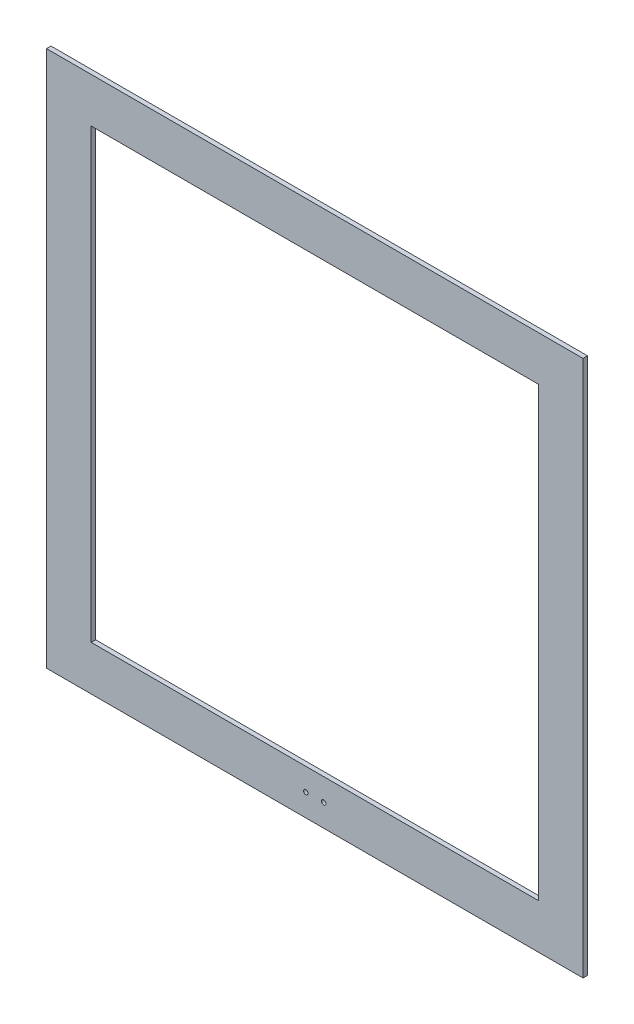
ISO-10303-21;
HEADER;
FILE_DESCRIPTION(('STEP AP214'),'2;1');
FILE_NAME('part.step','',(''),(''),'','','');
FILE_SCHEMA(('AUTOMOTIVE_DESIGN { 1 0 10303 214 1 1 1 1 }'));
ENDSEC;
DATA;
#1=APPLICATION_CONTEXT('core data for automotive mechanical design processes');
#2=APPLICATION_PROTOCOL_DEFINITION('international standard','automotive_design',2000,#1);
#3=PRODUCT_CONTEXT('',#1,'mechanical');
#4=PRODUCT('Part','Part','',(#3));
#5=PRODUCT_RELATED_PRODUCT_CATEGORY('part','',(#4));
#6=PRODUCT_DEFINITION_FORMATION('','',#4);
#7=PRODUCT_DEFINITION_CONTEXT('part definition',#1,'design');
#8=PRODUCT_DEFINITION('design','',#6,#7);
#9=PRODUCT_DEFINITION_SHAPE('','',#8);
#10=(LENGTH_UNIT() NAMED_UNIT(*) SI_UNIT(.MILLI.,.METRE.));
#11=(NAMED_UNIT(*) PLANE_ANGLE_UNIT() SI_UNIT($,.RADIAN.));
#12=(NAMED_UNIT(*) SI_UNIT($,.STERADIAN.) SOLID_ANGLE_UNIT());
#13=UNCERTAINTY_MEASURE_WITH_UNIT(LENGTH_MEASURE(1.E-05),#10,'distance_accuracy_value','');
#14=(GEOMETRIC_REPRESENTATION_CONTEXT(3) GLOBAL_UNCERTAINTY_ASSIGNED_CONTEXT((#13)) GLOBAL_UNIT_ASSIGNED_CONTEXT((#10,
#11,#12)) REPRESENTATION_CONTEXT('',''));
#15=CARTESIAN_POINT('',(0.,0.,0.));
#16=DIRECTION('',(0.,0.,1.));
#17=DIRECTION('',(1.,0.,0.));
#18=AXIS2_PLACEMENT_3D('',#15,#16,#17);
#19=CARTESIAN_POINT('',(0.,0.,5.));
#20=DIRECTION('',(0.,0.,1.));
#21=DIRECTION('',(1.,0.,0.));
#22=AXIS2_PLACEMENT_3D('',#19,#20,#21);
#23=PLANE('',#22);
#24=CARTESIAN_POINT('',(10.,-275.,5.));
#25=DIRECTION('',(0.,0.,1.));
#26=DIRECTION('',(-1.,0.,0.));
#27=AXIS2_PLACEMENT_3D('',#24,#25,#26);
#28=CIRCLE('',#27,2.5);
#29=CARTESIAN_POINT('',(7.5,-275.,5.));
#30=VERTEX_POINT('',#29);
#31=EDGE_CURVE('E226',#30,#30,#28,.T.);
#32=ORIENTED_EDGE('',*,*,#31,.F.);
#33=EDGE_LOOP('',(#32));
#34=FACE_BOUND('',#33,.T.);
#35=CARTESIAN_POINT('',(-10.,-275.,5.));
#36=DIRECTION('',(0.,0.,1.));
#37=DIRECTION('',(1.,0.,0.));
#38=AXIS2_PLACEMENT_3D('',#35,#36,#37);
#39=CIRCLE('',#38,2.5);
#40=CARTESIAN_POINT('',(-7.5,-275.,5.));
#41=VERTEX_POINT('',#40);
#42=EDGE_CURVE('E230',#41,#41,#39,.T.);
#43=ORIENTED_EDGE('',*,*,#42,.F.);
#44=EDGE_LOOP('',(#43));
#45=FACE_BOUND('',#44,.T.);
#46=DIRECTION('',(0.,1.,0.));
#47=VECTOR('',#46,1.);
#48=CARTESIAN_POINT('',(300.,300.,5.));
#49=LINE('',#48,#47);
#50=CARTESIAN_POINT('',(300.,-300.,5.));
#51=VERTEX_POINT('',#50);
#52=CARTESIAN_POINT('',(300.,300.,5.));
#53=VERTEX_POINT('',#52);
#54=EDGE_CURVE('E135',#51,#53,#49,.T.);
#55=ORIENTED_EDGE('',*,*,#54,.T.);
#56=DIRECTION('',(-1.,0.,0.));
#57=VECTOR('',#56,1.);
#58=CARTESIAN_POINT('',(-299.999999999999,300.,5.));
#59=LINE('',#58,#57);
#60=CARTESIAN_POINT('',(-299.999999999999,300.,5.));
#61=VERTEX_POINT('',#60);
#62=EDGE_CURVE('E138',#53,#61,#59,.T.);
#63=ORIENTED_EDGE('',*,*,#62,.T.);
#64=DIRECTION('',(0.,-1.,0.));
#65=VECTOR('',#64,1.);
#66=CARTESIAN_POINT('',(-299.999999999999,300.,5.));
#67=LINE('',#66,#65);
#68=CARTESIAN_POINT('',(-299.999999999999,-300.,5.));
#69=VERTEX_POINT('',#68);
#70=EDGE_CURVE('E141',#61,#69,#67,.T.);
#71=ORIENTED_EDGE('',*,*,#70,.T.);
#72=DIRECTION('',(1.,0.,0.));
#73=VECTOR('',#72,1.);
#74=CARTESIAN_POINT('',(-299.999999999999,-300.,5.));
#75=LINE('',#74,#73);
#76=EDGE_CURVE('E143',#69,#51,#75,.T.);
#77=ORIENTED_EDGE('',*,*,#76,.T.);
#78=EDGE_LOOP('',(#55,#63,#71,#77));
#79=FACE_BOUND('',#78,.T.);
#80=DIRECTION('',(-1.,0.,0.));
#81=VECTOR('',#80,1.);
#82=CARTESIAN_POINT('',(-250.,250.,5.));
#83=LINE('',#82,#81);
#84=CARTESIAN_POINT('',(250.,250.,5.));
#85=VERTEX_POINT('',#84);
#86=CARTESIAN_POINT('',(-250.,250.,5.));
#87=VERTEX_POINT('',#86);
#88=EDGE_CURVE('E105',#85,#87,#83,.T.);
#89=ORIENTED_EDGE('',*,*,#88,.F.);
#90=DIRECTION('',(0.,1.,0.));
#91=VECTOR('',#90,1.);
#92=CARTESIAN_POINT('',(250.,250.,5.));
#93=LINE('',#92,#91);
#94=CARTESIAN_POINT('',(250.,-250.,5.));
#95=VERTEX_POINT('',#94);
#96=EDGE_CURVE('E97',#95,#85,#93,.T.);
#97=ORIENTED_EDGE('',*,*,#96,.F.);
#98=DIRECTION('',(1.,0.,0.));
#99=VECTOR('',#98,1.);
#100=CARTESIAN_POINT('',(-250.,-250.,5.));
#101=LINE('',#100,#99);
#102=CARTESIAN_POINT('',(-250.,-250.,5.));
#103=VERTEX_POINT('',#102);
#104=EDGE_CURVE('E119',#103,#95,#101,.T.);
#105=ORIENTED_EDGE('',*,*,#104,.F.);
#106=DIRECTION('',(0.,-1.,0.));
#107=VECTOR('',#106,1.);
#108=CARTESIAN_POINT('',(-250.,250.,5.));
#109=LINE('',#108,#107);
#110=EDGE_CURVE('E117',#87,#103,#109,.T.);
#111=ORIENTED_EDGE('',*,*,#110,.F.);
#112=EDGE_LOOP('',(#89,#97,#105,#111));
#113=FACE_BOUND('',#112,.T.);
#114=ADVANCED_FACE('F32',(#34,#45,#79,#113),#23,.T.);
#115=CARTESIAN_POINT('',(0.,0.,0.));
#116=DIRECTION('',(0.,0.,1.));
#117=DIRECTION('',(1.,0.,0.));
#118=AXIS2_PLACEMENT_3D('',#115,#116,#117);
#119=PLANE('',#118);
#120=CARTESIAN_POINT('',(10.,-275.,0.));
#121=DIRECTION('',(0.,0.,1.));
#122=DIRECTION('',(1.,0.,0.));
#123=AXIS2_PLACEMENT_3D('',#120,#121,#122);
#124=CIRCLE('',#123,2.5);
#125=CARTESIAN_POINT('',(12.5,-275.,0.));
#126=VERTEX_POINT('',#125);
#127=EDGE_CURVE('E229',#126,#126,#124,.F.);
#128=ORIENTED_EDGE('',*,*,#127,.F.);
#129=EDGE_LOOP('',(#128));
#130=FACE_BOUND('',#129,.T.);
#131=CARTESIAN_POINT('',(-10.,-275.,0.));
#132=DIRECTION('',(0.,0.,1.));
#133=DIRECTION('',(1.,0.,0.));
#134=AXIS2_PLACEMENT_3D('',#131,#132,#133);
#135=CIRCLE('',#134,2.5);
#136=CARTESIAN_POINT('',(-7.5,-275.,0.));
#137=VERTEX_POINT('',#136);
#138=EDGE_CURVE('E125',#137,#137,#135,.F.);
#139=ORIENTED_EDGE('',*,*,#138,.F.);
#140=EDGE_LOOP('',(#139));
#141=FACE_BOUND('',#140,.T.);
#142=DIRECTION('',(0.,1.,0.));
#143=VECTOR('',#142,1.);
#144=CARTESIAN_POINT('',(300.,300.,0.));
#145=LINE('',#144,#143);
#146=CARTESIAN_POINT('',(300.,-300.,0.));
#147=VERTEX_POINT('',#146);
#148=CARTESIAN_POINT('',(300.,300.,0.));
#149=VERTEX_POINT('',#148);
#150=EDGE_CURVE('E113',#147,#149,#145,.T.);
#151=ORIENTED_EDGE('',*,*,#150,.F.);
#152=DIRECTION('',(1.,0.,0.));
#153=VECTOR('',#152,1.);
#154=CARTESIAN_POINT('',(-299.999999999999,-300.,0.));
#155=LINE('',#154,#153);
#156=CARTESIAN_POINT('',(-299.999999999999,-300.,0.));
#157=VERTEX_POINT('',#156);
#158=EDGE_CURVE('E139',#157,#147,#155,.T.);
#159=ORIENTED_EDGE('',*,*,#158,.F.);
#160=DIRECTION('',(0.,-1.,0.));
#161=VECTOR('',#160,1.);
#162=CARTESIAN_POINT('',(-299.999999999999,300.,0.));
#163=LINE('',#162,#161);
#164=CARTESIAN_POINT('',(-299.999999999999,300.,0.));
#165=VERTEX_POINT('',#164);
#166=EDGE_CURVE('E150',#165,#157,#163,.T.);
#167=ORIENTED_EDGE('',*,*,#166,.F.);
#168=DIRECTION('',(-1.,0.,0.));
#169=VECTOR('',#168,1.);
#170=CARTESIAN_POINT('',(-299.999999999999,300.,0.));
#171=LINE('',#170,#169);
#172=EDGE_CURVE('E148',#149,#165,#171,.T.);
#173=ORIENTED_EDGE('',*,*,#172,.F.);
#174=EDGE_LOOP('',(#151,#159,#167,#173));
#175=FACE_BOUND('',#174,.T.);
#176=DIRECTION('',(0.,1.,0.));
#177=VECTOR('',#176,1.);
#178=CARTESIAN_POINT('',(250.,250.,0.));
#179=LINE('',#178,#177);
#180=CARTESIAN_POINT('',(250.,-250.,0.));
#181=VERTEX_POINT('',#180);
#182=CARTESIAN_POINT('',(250.,250.,0.));
#183=VERTEX_POINT('',#182);
#184=EDGE_CURVE('E55',#181,#183,#179,.T.);
#185=ORIENTED_EDGE('',*,*,#184,.T.);
#186=DIRECTION('',(-1.,0.,0.));
#187=VECTOR('',#186,1.);
#188=CARTESIAN_POINT('',(-250.,250.,0.));
#189=LINE('',#188,#187);
#190=CARTESIAN_POINT('',(-250.,250.,0.));
#191=VERTEX_POINT('',#190);
#192=EDGE_CURVE('E112',#183,#191,#189,.T.);
#193=ORIENTED_EDGE('',*,*,#192,.T.);
#194=DIRECTION('',(0.,-1.,0.));
#195=VECTOR('',#194,1.);
#196=CARTESIAN_POINT('',(-250.,250.,0.));
#197=LINE('',#196,#195);
#198=CARTESIAN_POINT('',(-250.,-250.,0.));
#199=VERTEX_POINT('',#198);
#200=EDGE_CURVE('E127',#191,#199,#197,.T.);
#201=ORIENTED_EDGE('',*,*,#200,.T.);
#202=DIRECTION('',(1.,0.,0.));
#203=VECTOR('',#202,1.);
#204=CARTESIAN_POINT('',(-250.,-250.,0.));
#205=LINE('',#204,#203);
#206=EDGE_CURVE('E106',#199,#181,#205,.T.);
#207=ORIENTED_EDGE('',*,*,#206,.T.);
#208=EDGE_LOOP('',(#185,#193,#201,#207));
#209=FACE_BOUND('',#208,.T.);
#210=ADVANCED_FACE('F168',(#130,#141,#175,#209),#119,.F.);
#211=CARTESIAN_POINT('',(300.,300.,5.));
#212=DIRECTION('',(-1.,0.,0.));
#213=DIRECTION('',(0.,0.,1.));
#214=AXIS2_PLACEMENT_3D('',#211,#212,#213);
#215=PLANE('',#214);
#216=ORIENTED_EDGE('',*,*,#150,.T.);
#217=DIRECTION('',(0.,0.,-1.));
#218=VECTOR('',#217,1.);
#219=CARTESIAN_POINT('',(300.,300.,5.));
#220=LINE('',#219,#218);
#221=EDGE_CURVE('E11',#53,#149,#220,.T.);
#222=ORIENTED_EDGE('',*,*,#221,.F.);
#223=ORIENTED_EDGE('',*,*,#54,.F.);
#224=DIRECTION('',(0.,0.,-1.));
#225=VECTOR('',#224,1.);
#226=CARTESIAN_POINT('',(300.,-300.,5.));
#227=LINE('',#226,#225);
#228=EDGE_CURVE('E145',#51,#147,#227,.T.);
#229=ORIENTED_EDGE('',*,*,#228,.T.);
#230=EDGE_LOOP('',(#216,#222,#223,#229));
#231=FACE_BOUND('',#230,.T.);
#232=ADVANCED_FACE('F34',(#231),#215,.F.);
#233=CARTESIAN_POINT('',(-299.999999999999,300.,5.));
#234=DIRECTION('',(0.,-1.,0.));
#235=DIRECTION('',(1.,0.,0.));
#236=AXIS2_PLACEMENT_3D('',#233,#234,#235);
#237=PLANE('',#236);
#238=ORIENTED_EDGE('',*,*,#172,.T.);
#239=DIRECTION('',(0.,0.,-1.));
#240=VECTOR('',#239,1.);
#241=CARTESIAN_POINT('',(-299.999999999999,300.,5.));
#242=LINE('',#241,#240);
#243=EDGE_CURVE('E40',#61,#165,#242,.T.);
#244=ORIENTED_EDGE('',*,*,#243,.F.);
#245=ORIENTED_EDGE('',*,*,#62,.F.);
#246=ORIENTED_EDGE('',*,*,#221,.T.);
#247=EDGE_LOOP('',(#238,#244,#245,#246));
#248=FACE_BOUND('',#247,.T.);
#249=ADVANCED_FACE('F178',(#248),#237,.F.);
#250=CARTESIAN_POINT('',(-299.999999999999,300.,5.));
#251=DIRECTION('',(1.,0.,0.));
#252=DIRECTION('',(0.,0.,-1.));
#253=AXIS2_PLACEMENT_3D('',#250,#251,#252);
#254=PLANE('',#253);
#255=ORIENTED_EDGE('',*,*,#166,.T.);
#256=DIRECTION('',(0.,0.,-1.));
#257=VECTOR('',#256,1.);
#258=CARTESIAN_POINT('',(-299.999999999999,-300.,5.));
#259=LINE('',#258,#257);
#260=EDGE_CURVE('E155',#69,#157,#259,.T.);
#261=ORIENTED_EDGE('',*,*,#260,.F.);
#262=ORIENTED_EDGE('',*,*,#70,.F.);
#263=ORIENTED_EDGE('',*,*,#243,.T.);
#264=EDGE_LOOP('',(#255,#261,#262,#263));
#265=FACE_BOUND('',#264,.T.);
#266=ADVANCED_FACE('F162',(#265),#254,.F.);
#267=CARTESIAN_POINT('',(-299.999999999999,-300.,5.));
#268=DIRECTION('',(0.,1.,0.));
#269=DIRECTION('',(0.,0.,1.));
#270=AXIS2_PLACEMENT_3D('',#267,#268,#269);
#271=PLANE('',#270);
#272=ORIENTED_EDGE('',*,*,#158,.T.);
#273=ORIENTED_EDGE('',*,*,#228,.F.);
#274=ORIENTED_EDGE('',*,*,#76,.F.);
#275=ORIENTED_EDGE('',*,*,#260,.T.);
#276=EDGE_LOOP('',(#272,#273,#274,#275));
#277=FACE_BOUND('',#276,.T.);
#278=ADVANCED_FACE('F172',(#277),#271,.F.);
#279=CARTESIAN_POINT('',(250.,250.,5.));
#280=DIRECTION('',(-1.,0.,0.));
#281=DIRECTION('',(0.,-1.,0.));
#282=AXIS2_PLACEMENT_3D('',#279,#280,#281);
#283=PLANE('',#282);
#284=ORIENTED_EDGE('',*,*,#184,.F.);
#285=DIRECTION('',(0.,0.,-1.));
#286=VECTOR('',#285,1.);
#287=CARTESIAN_POINT('',(250.,-250.,5.));
#288=LINE('',#287,#286);
#289=EDGE_CURVE('E101',#95,#181,#288,.T.);
#290=ORIENTED_EDGE('',*,*,#289,.F.);
#291=ORIENTED_EDGE('',*,*,#96,.T.);
#292=DIRECTION('',(0.,0.,-1.));
#293=VECTOR('',#292,1.);
#294=CARTESIAN_POINT('',(250.,250.,5.));
#295=LINE('',#294,#293);
#296=EDGE_CURVE('E100',#85,#183,#295,.T.);
#297=ORIENTED_EDGE('',*,*,#296,.T.);
#298=EDGE_LOOP('',(#284,#290,#291,#297));
#299=FACE_BOUND('',#298,.T.);
#300=ADVANCED_FACE('F99',(#299),#283,.T.);
#301=CARTESIAN_POINT('',(-250.,250.,5.));
#302=DIRECTION('',(0.,-1.,0.));
#303=DIRECTION('',(1.,0.,0.));
#304=AXIS2_PLACEMENT_3D('',#301,#302,#303);
#305=PLANE('',#304);
#306=ORIENTED_EDGE('',*,*,#192,.F.);
#307=ORIENTED_EDGE('',*,*,#296,.F.);
#308=ORIENTED_EDGE('',*,*,#88,.T.);
#309=DIRECTION('',(0.,0.,-1.));
#310=VECTOR('',#309,1.);
#311=CARTESIAN_POINT('',(-250.,250.,5.));
#312=LINE('',#311,#310);
#313=EDGE_CURVE('E114',#87,#191,#312,.T.);
#314=ORIENTED_EDGE('',*,*,#313,.T.);
#315=EDGE_LOOP('',(#306,#307,#308,#314));
#316=FACE_BOUND('',#315,.T.);
#317=ADVANCED_FACE('F109',(#316),#305,.T.);
#318=CARTESIAN_POINT('',(-250.,250.,5.));
#319=DIRECTION('',(1.,0.,0.));
#320=DIRECTION('',(0.,0.,-1.));
#321=AXIS2_PLACEMENT_3D('',#318,#319,#320);
#322=PLANE('',#321);
#323=ORIENTED_EDGE('',*,*,#200,.F.);
#324=ORIENTED_EDGE('',*,*,#313,.F.);
#325=ORIENTED_EDGE('',*,*,#110,.T.);
#326=DIRECTION('',(0.,0.,-1.));
#327=VECTOR('',#326,1.);
#328=CARTESIAN_POINT('',(-250.,-250.,5.));
#329=LINE('',#328,#327);
#330=EDGE_CURVE('E47',#103,#199,#329,.T.);
#331=ORIENTED_EDGE('',*,*,#330,.T.);
#332=EDGE_LOOP('',(#323,#324,#325,#331));
#333=FACE_BOUND('',#332,.T.);
#334=ADVANCED_FACE('F205',(#333),#322,.T.);
#335=CARTESIAN_POINT('',(-250.,-250.,5.));
#336=DIRECTION('',(0.,1.,0.));
#337=DIRECTION('',(0.,0.,1.));
#338=AXIS2_PLACEMENT_3D('',#335,#336,#337);
#339=PLANE('',#338);
#340=ORIENTED_EDGE('',*,*,#206,.F.);
#341=ORIENTED_EDGE('',*,*,#330,.F.);
#342=ORIENTED_EDGE('',*,*,#104,.T.);
#343=ORIENTED_EDGE('',*,*,#289,.T.);
#344=EDGE_LOOP('',(#340,#341,#342,#343));
#345=FACE_BOUND('',#344,.T.);
#346=ADVANCED_FACE('F209',(#345),#339,.T.);
#347=CARTESIAN_POINT('',(-10.,-275.,-0.00100000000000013));
#348=DIRECTION('',(0.,0.,1.));
#349=DIRECTION('',(1.,0.,0.));
#350=AXIS2_PLACEMENT_3D('',#347,#348,#349);
#351=CYLINDRICAL_SURFACE('',#350,2.5);
#352=ORIENTED_EDGE('',*,*,#42,.T.);
#353=EDGE_LOOP('',(#352));
#354=FACE_BOUND('',#353,.T.);
#355=ORIENTED_EDGE('',*,*,#138,.T.);
#356=EDGE_LOOP('',(#355));
#357=FACE_BOUND('',#356,.T.);
#358=ADVANCED_FACE('F215',(#354,#357),#351,.F.);
#359=CARTESIAN_POINT('',(10.,-275.,-0.00100000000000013));
#360=DIRECTION('',(0.,0.,1.));
#361=DIRECTION('',(1.,0.,0.));
#362=AXIS2_PLACEMENT_3D('',#359,#360,#361);
#363=CYLINDRICAL_SURFACE('',#362,2.5);
#364=ORIENTED_EDGE('',*,*,#31,.T.);
#365=EDGE_LOOP('',(#364));
#366=FACE_BOUND('',#365,.T.);
#367=ORIENTED_EDGE('',*,*,#127,.T.);
#368=EDGE_LOOP('',(#367));
#369=FACE_BOUND('',#368,.T.);
#370=ADVANCED_FACE('F218',(#366,#369),#363,.F.);
#371=CLOSED_SHELL('',(#114,#210,#232,#249,#266,#278,#300,#317,#334,#346,#358,#370));
#372=MANIFOLD_SOLID_BREP('B2',#371);
#373=ADVANCED_BREP_SHAPE_REPRESENTATION('',(#18,#372),#14);
#374=SHAPE_DEFINITION_REPRESENTATION(#9,#373);
ENDSEC;
END-ISO-10303-21;
